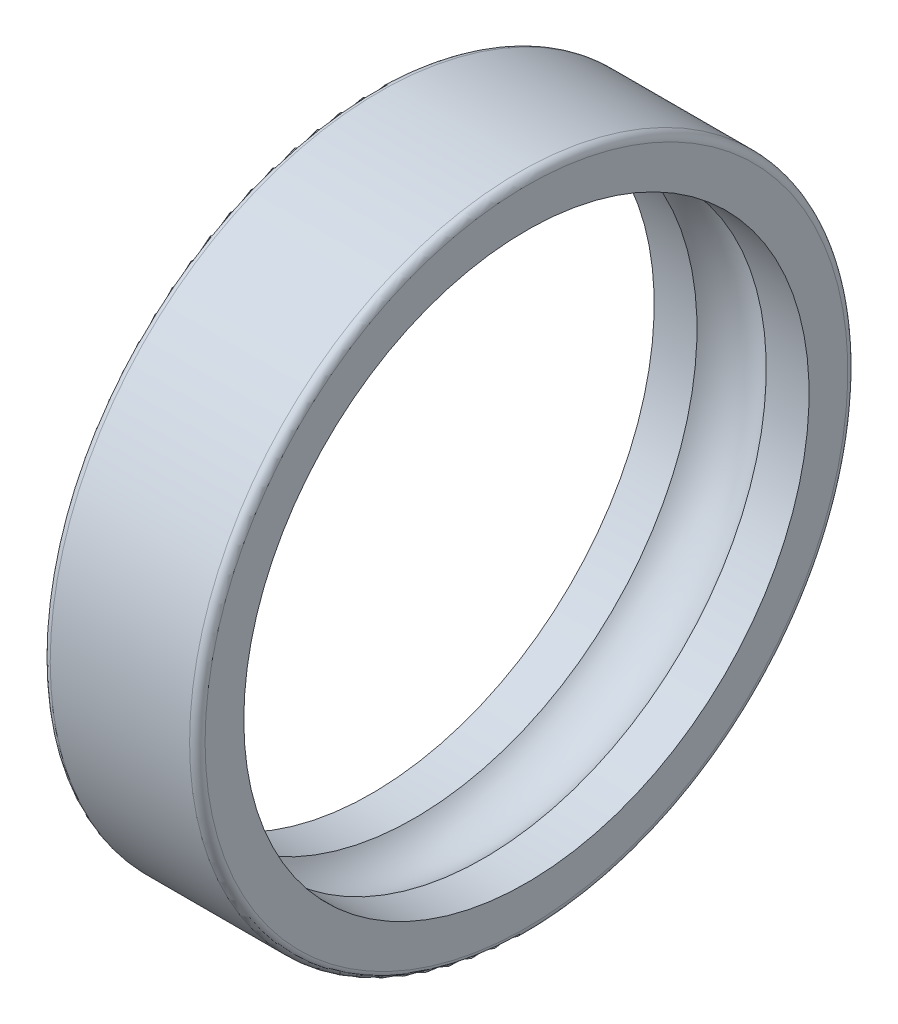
ISO-10303-21;
HEADER;
FILE_DESCRIPTION(('STEP AP214'),'2;1');
FILE_NAME('part.step','',(''),(''),'','','');
FILE_SCHEMA(('AUTOMOTIVE_DESIGN { 1 0 10303 214 1 1 1 1 }'));
ENDSEC;
DATA;
#1=APPLICATION_CONTEXT('core data for automotive mechanical design processes');
#2=APPLICATION_PROTOCOL_DEFINITION('international standard','automotive_design',2000,#1);
#3=PRODUCT_CONTEXT('',#1,'mechanical');
#4=PRODUCT('Part','Part','',(#3));
#5=PRODUCT_RELATED_PRODUCT_CATEGORY('part','',(#4));
#6=PRODUCT_DEFINITION_FORMATION('','',#4);
#7=PRODUCT_DEFINITION_CONTEXT('part definition',#1,'design');
#8=PRODUCT_DEFINITION('design','',#6,#7);
#9=PRODUCT_DEFINITION_SHAPE('','',#8);
#10=(LENGTH_UNIT() NAMED_UNIT(*) SI_UNIT(.MILLI.,.METRE.));
#11=(NAMED_UNIT(*) PLANE_ANGLE_UNIT() SI_UNIT($,.RADIAN.));
#12=(NAMED_UNIT(*) SI_UNIT($,.STERADIAN.) SOLID_ANGLE_UNIT());
#13=UNCERTAINTY_MEASURE_WITH_UNIT(LENGTH_MEASURE(1.E-05),#10,'distance_accuracy_value','');
#14=(GEOMETRIC_REPRESENTATION_CONTEXT(3) GLOBAL_UNCERTAINTY_ASSIGNED_CONTEXT((#13)) GLOBAL_UNIT_ASSIGNED_CONTEXT((#10,
#11,#12)) REPRESENTATION_CONTEXT('',''));
#15=CARTESIAN_POINT('',(0.,0.,0.));
#16=DIRECTION('',(0.,0.,1.));
#17=DIRECTION('',(1.,0.,0.));
#18=AXIS2_PLACEMENT_3D('',#15,#16,#17);
#19=CARTESIAN_POINT('',(0.200000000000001,0.,0.));
#20=DIRECTION('',(-1.,0.,0.));
#21=DIRECTION('',(0.,0.,1.));
#22=AXIS2_PLACEMENT_3D('',#19,#20,#21);
#23=TOROIDAL_SURFACE('',#22,8.3,0.2);
#24=CARTESIAN_POINT('',(0.,0.,0.));
#25=DIRECTION('',(-1.,0.,0.));
#26=DIRECTION('',(0.,0.,1.));
#27=AXIS2_PLACEMENT_3D('',#24,#25,#26);
#28=CIRCLE('',#27,8.3);
#29=CARTESIAN_POINT('',(0.,0.,8.3));
#30=VERTEX_POINT('',#29);
#31=EDGE_CURVE('E10',#30,#30,#28,.T.);
#32=ORIENTED_EDGE('',*,*,#31,.F.);
#33=EDGE_LOOP('',(#32));
#34=FACE_BOUND('',#33,.T.);
#35=CARTESIAN_POINT('',(0.200000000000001,0.,0.));
#36=DIRECTION('',(-1.,0.,0.));
#37=DIRECTION('',(0.,0.,1.));
#38=AXIS2_PLACEMENT_3D('',#35,#36,#37);
#39=CIRCLE('',#38,8.5);
#40=CARTESIAN_POINT('',(0.200000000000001,0.,8.5));
#41=VERTEX_POINT('',#40);
#42=EDGE_CURVE('E378',#41,#41,#39,.T.);
#43=ORIENTED_EDGE('',*,*,#42,.T.);
#44=EDGE_LOOP('',(#43));
#45=FACE_BOUND('',#44,.T.);
#46=ADVANCED_FACE('F350',(#34,#45),#23,.T.);
#47=CARTESIAN_POINT('',(0.,0.,-8.3));
#48=DIRECTION('',(1.,0.,0.));
#49=DIRECTION('',(0.,0.,-1.));
#50=AXIS2_PLACEMENT_3D('',#47,#48,#49);
#51=PLANE('',#50);
#52=CARTESIAN_POINT('',(0.,0.,0.));
#53=DIRECTION('',(-1.,0.,0.));
#54=DIRECTION('',(0.,0.,1.));
#55=AXIS2_PLACEMENT_3D('',#52,#53,#54);
#56=CIRCLE('',#55,7.3);
#57=CARTESIAN_POINT('',(0.,0.,7.3));
#58=VERTEX_POINT('',#57);
#59=EDGE_CURVE('E356',#58,#58,#56,.T.);
#60=ORIENTED_EDGE('',*,*,#59,.F.);
#61=EDGE_LOOP('',(#60));
#62=FACE_BOUND('',#61,.T.);
#63=ORIENTED_EDGE('',*,*,#31,.T.);
#64=EDGE_LOOP('',(#63));
#65=FACE_BOUND('',#64,.T.);
#66=ADVANCED_FACE('F415',(#62,#65),#51,.F.);
#67=CARTESIAN_POINT('',(0.,0.,0.));
#68=DIRECTION('',(-1.,0.,0.));
#69=DIRECTION('',(0.,0.,1.));
#70=AXIS2_PLACEMENT_3D('',#67,#68,#69);
#71=CYLINDRICAL_SURFACE('',#70,7.3);
#72=CARTESIAN_POINT('',(1.10557280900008,0.,0.));
#73=DIRECTION('',(-1.,0.,0.));
#74=DIRECTION('',(0.,0.,1.));
#75=AXIS2_PLACEMENT_3D('',#72,#73,#74);
#76=CIRCLE('',#75,7.3);
#77=CARTESIAN_POINT('',(1.10557280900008,0.,7.3));
#78=VERTEX_POINT('',#77);
#79=EDGE_CURVE('E360',#78,#78,#76,.T.);
#80=ORIENTED_EDGE('',*,*,#79,.F.);
#81=EDGE_LOOP('',(#80));
#82=FACE_BOUND('',#81,.T.);
#83=ORIENTED_EDGE('',*,*,#59,.T.);
#84=EDGE_LOOP('',(#83));
#85=FACE_BOUND('',#84,.T.);
#86=ADVANCED_FACE('F410',(#82,#85),#71,.F.);
#87=CARTESIAN_POINT('',(2.,0.,0.));
#88=DIRECTION('',(-1.,0.,0.));
#89=DIRECTION('',(0.,0.,1.));
#90=AXIS2_PLACEMENT_3D('',#87,#88,#89);
#91=TOROIDAL_SURFACE('',#90,6.5,1.2);
#92=CARTESIAN_POINT('',(2.89442719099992,0.,0.));
#93=DIRECTION('',(-1.,0.,0.));
#94=DIRECTION('',(0.,0.,1.));
#95=AXIS2_PLACEMENT_3D('',#92,#93,#94);
#96=CIRCLE('',#95,7.3);
#97=CARTESIAN_POINT('',(2.89442719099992,0.,7.3));
#98=VERTEX_POINT('',#97);
#99=EDGE_CURVE('E364',#98,#98,#96,.T.);
#100=ORIENTED_EDGE('',*,*,#99,.F.);
#101=EDGE_LOOP('',(#100));
#102=FACE_BOUND('',#101,.T.);
#103=ORIENTED_EDGE('',*,*,#79,.T.);
#104=EDGE_LOOP('',(#103));
#105=FACE_BOUND('',#104,.T.);
#106=ADVANCED_FACE('F404',(#102,#105),#91,.F.);
#107=CARTESIAN_POINT('',(0.,0.,0.));
#108=DIRECTION('',(-1.,0.,0.));
#109=DIRECTION('',(0.,0.,1.));
#110=AXIS2_PLACEMENT_3D('',#107,#108,#109);
#111=CYLINDRICAL_SURFACE('',#110,7.3);
#112=CARTESIAN_POINT('',(4.,0.,0.));
#113=DIRECTION('',(-1.,0.,0.));
#114=DIRECTION('',(0.,0.,1.));
#115=AXIS2_PLACEMENT_3D('',#112,#113,#114);
#116=CIRCLE('',#115,7.3);
#117=CARTESIAN_POINT('',(4.,0.,7.3));
#118=VERTEX_POINT('',#117);
#119=EDGE_CURVE('E369',#118,#118,#116,.T.);
#120=ORIENTED_EDGE('',*,*,#119,.F.);
#121=EDGE_LOOP('',(#120));
#122=FACE_BOUND('',#121,.T.);
#123=ORIENTED_EDGE('',*,*,#99,.T.);
#124=EDGE_LOOP('',(#123));
#125=FACE_BOUND('',#124,.T.);
#126=ADVANCED_FACE('F398',(#122,#125),#111,.F.);
#127=CARTESIAN_POINT('',(4.,0.,-8.3));
#128=DIRECTION('',(-1.,0.,0.));
#129=DIRECTION('',(0.,0.,1.));
#130=AXIS2_PLACEMENT_3D('',#127,#128,#129);
#131=PLANE('',#130);
#132=CARTESIAN_POINT('',(4.,0.,0.));
#133=DIRECTION('',(-1.,0.,0.));
#134=DIRECTION('',(0.,0.,1.));
#135=AXIS2_PLACEMENT_3D('',#132,#133,#134);
#136=CIRCLE('',#135,8.3);
#137=CARTESIAN_POINT('',(4.,0.,8.3));
#138=VERTEX_POINT('',#137);
#139=EDGE_CURVE('E372',#138,#138,#136,.T.);
#140=ORIENTED_EDGE('',*,*,#139,.F.);
#141=EDGE_LOOP('',(#140));
#142=FACE_BOUND('',#141,.T.);
#143=ORIENTED_EDGE('',*,*,#119,.T.);
#144=EDGE_LOOP('',(#143));
#145=FACE_BOUND('',#144,.T.);
#146=ADVANCED_FACE('F392',(#142,#145),#131,.F.);
#147=CARTESIAN_POINT('',(3.8,0.,0.));
#148=DIRECTION('',(-1.,0.,0.));
#149=DIRECTION('',(0.,0.,1.));
#150=AXIS2_PLACEMENT_3D('',#147,#148,#149);
#151=TOROIDAL_SURFACE('',#150,8.3,0.200000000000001);
#152=CARTESIAN_POINT('',(3.8,0.,0.));
#153=DIRECTION('',(-1.,0.,0.));
#154=DIRECTION('',(0.,0.,1.));
#155=AXIS2_PLACEMENT_3D('',#152,#153,#154);
#156=CIRCLE('',#155,8.5);
#157=CARTESIAN_POINT('',(3.8,0.,8.5));
#158=VERTEX_POINT('',#157);
#159=EDGE_CURVE('E375',#158,#158,#156,.T.);
#160=ORIENTED_EDGE('',*,*,#159,.F.);
#161=EDGE_LOOP('',(#160));
#162=FACE_BOUND('',#161,.T.);
#163=ORIENTED_EDGE('',*,*,#139,.T.);
#164=EDGE_LOOP('',(#163));
#165=FACE_BOUND('',#164,.T.);
#166=ADVANCED_FACE('F386',(#162,#165),#151,.T.);
#167=CARTESIAN_POINT('',(0.,0.,0.));
#168=DIRECTION('',(-1.,0.,0.));
#169=DIRECTION('',(0.,0.,1.));
#170=AXIS2_PLACEMENT_3D('',#167,#168,#169);
#171=CYLINDRICAL_SURFACE('',#170,8.5);
#172=ORIENTED_EDGE('',*,*,#42,.F.);
#173=EDGE_LOOP('',(#172));
#174=FACE_BOUND('',#173,.T.);
#175=ORIENTED_EDGE('',*,*,#159,.T.);
#176=EDGE_LOOP('',(#175));
#177=FACE_BOUND('',#176,.T.);
#178=ADVANCED_FACE('F383',(#174,#177),#171,.T.);
#179=CLOSED_SHELL('',(#46,#66,#86,#106,#126,#146,#166,#178));
#180=MANIFOLD_SOLID_BREP('B2',#179);
#181=ADVANCED_BREP_SHAPE_REPRESENTATION('',(#18,#180),#14);
#182=SHAPE_DEFINITION_REPRESENTATION(#9,#181);
ENDSEC;
END-ISO-10303-21;
